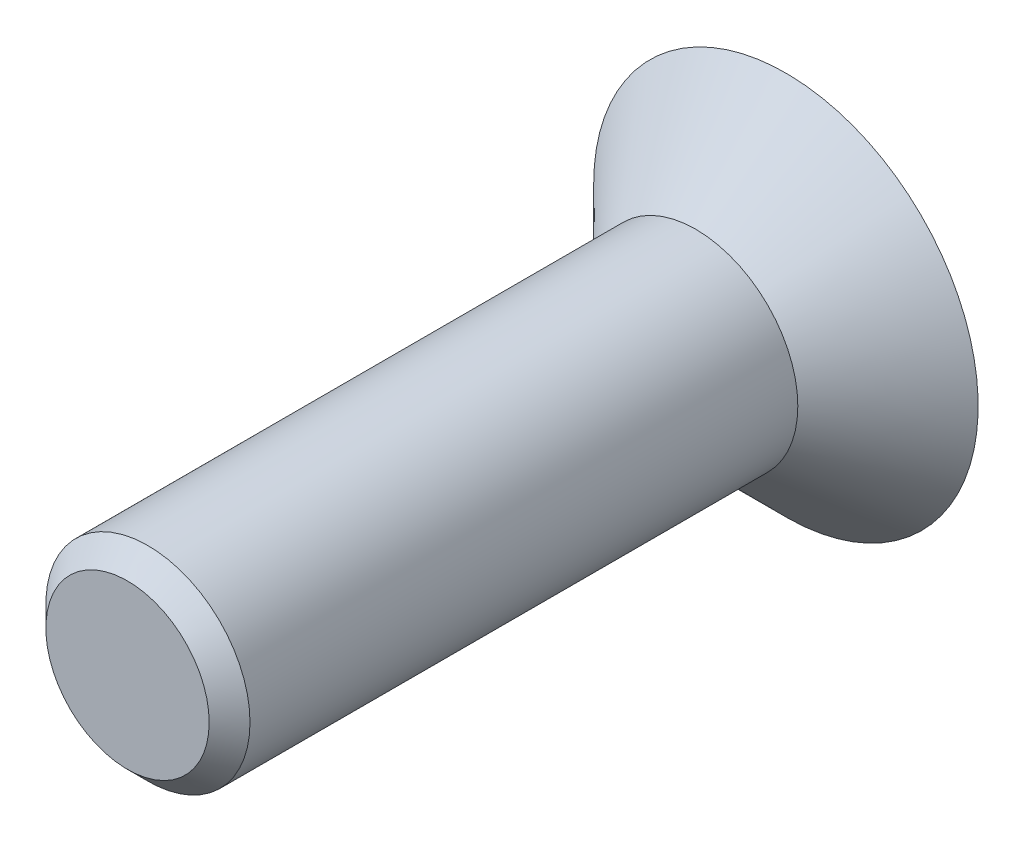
ISO-10303-21;
HEADER;
FILE_DESCRIPTION(('STEP AP214'),'2;1');
FILE_NAME('part.step','',(''),(''),'','','');
FILE_SCHEMA(('AUTOMOTIVE_DESIGN { 1 0 10303 214 1 1 1 1 }'));
ENDSEC;
DATA;
#1=APPLICATION_CONTEXT('core data for automotive mechanical design processes');
#2=APPLICATION_PROTOCOL_DEFINITION('international standard','automotive_design',2000,#1);
#3=PRODUCT_CONTEXT('',#1,'mechanical');
#4=PRODUCT('Part','Part','',(#3));
#5=PRODUCT_RELATED_PRODUCT_CATEGORY('part','',(#4));
#6=PRODUCT_DEFINITION_FORMATION('','',#4);
#7=PRODUCT_DEFINITION_CONTEXT('part definition',#1,'design');
#8=PRODUCT_DEFINITION('design','',#6,#7);
#9=PRODUCT_DEFINITION_SHAPE('','',#8);
#10=(LENGTH_UNIT() NAMED_UNIT(*) SI_UNIT(.MILLI.,.METRE.));
#11=(NAMED_UNIT(*) PLANE_ANGLE_UNIT() SI_UNIT($,.RADIAN.));
#12=(NAMED_UNIT(*) SI_UNIT($,.STERADIAN.) SOLID_ANGLE_UNIT());
#13=UNCERTAINTY_MEASURE_WITH_UNIT(LENGTH_MEASURE(1.E-05),#10,'distance_accuracy_value','');
#14=(GEOMETRIC_REPRESENTATION_CONTEXT(3) GLOBAL_UNCERTAINTY_ASSIGNED_CONTEXT((#13)) GLOBAL_UNIT_ASSIGNED_CONTEXT((#10,
#11,#12)) REPRESENTATION_CONTEXT('',''));
#15=CARTESIAN_POINT('',(0.,0.,0.));
#16=DIRECTION('',(0.,0.,1.));
#17=DIRECTION('',(1.,0.,0.));
#18=AXIS2_PLACEMENT_3D('',#15,#16,#17);
#19=CARTESIAN_POINT('',(0.,0.,-2.65));
#20=DIRECTION('',(0.,0.,1.));
#21=DIRECTION('',(1.,0.,0.));
#22=AXIS2_PLACEMENT_3D('',#19,#20,#21);
#23=PLANE('',#22);
#24=CARTESIAN_POINT('',(0.,0.,-2.65));
#25=DIRECTION('',(0.,0.,-1.));
#26=DIRECTION('',(-1.,0.,0.));
#27=AXIS2_PLACEMENT_3D('',#24,#25,#26);
#28=CIRCLE('',#27,5.65);
#29=CARTESIAN_POINT('',(-5.65,0.,-2.65));
#30=VERTEX_POINT('',#29);
#31=EDGE_CURVE('E86',#30,#30,#28,.T.);
#32=ORIENTED_EDGE('',*,*,#31,.T.);
#33=EDGE_LOOP('',(#32));
#34=FACE_BOUND('',#33,.T.);
#35=DIRECTION('',(-0.86602540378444,0.499999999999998,0.));
#36=VECTOR('',#35,1.);
#37=CARTESIAN_POINT('',(0.,2.30940107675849,-2.65000000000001));
#38=LINE('',#37,#36);
#39=CARTESIAN_POINT('',(2.00000000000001,1.15470053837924,-2.65));
#40=VERTEX_POINT('',#39);
#41=CARTESIAN_POINT('',(0.,2.30940107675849,-2.65000000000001));
#42=VERTEX_POINT('',#41);
#43=EDGE_CURVE('E43',#40,#42,#38,.T.);
#44=ORIENTED_EDGE('',*,*,#43,.T.);
#45=DIRECTION('',(-0.866025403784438,-0.500000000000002,0.));
#46=VECTOR('',#45,1.);
#47=CARTESIAN_POINT('',(-1.99999999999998,1.15470053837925,-2.65000000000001));
#48=LINE('',#47,#46);
#49=CARTESIAN_POINT('',(-1.99999999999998,1.15470053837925,-2.65000000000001));
#50=VERTEX_POINT('',#49);
#51=EDGE_CURVE('E143',#42,#50,#48,.T.);
#52=ORIENTED_EDGE('',*,*,#51,.T.);
#53=DIRECTION('',(0.,-1.,0.));
#54=VECTOR('',#53,1.);
#55=CARTESIAN_POINT('',(-1.99999999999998,-1.15470053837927,-2.65));
#56=LINE('',#55,#54);
#57=CARTESIAN_POINT('',(-1.99999999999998,-1.15470053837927,-2.65));
#58=VERTEX_POINT('',#57);
#59=EDGE_CURVE('E146',#50,#58,#56,.T.);
#60=ORIENTED_EDGE('',*,*,#59,.T.);
#61=DIRECTION('',(0.866025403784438,-0.500000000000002,0.));
#62=VECTOR('',#61,1.);
#63=CARTESIAN_POINT('',(-1.99999999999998,-1.15470053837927,-2.65));
#64=LINE('',#63,#62);
#65=CARTESIAN_POINT('',(0.,-2.30940107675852,-2.65));
#66=VERTEX_POINT('',#65);
#67=EDGE_CURVE('E152',#58,#66,#64,.T.);
#68=ORIENTED_EDGE('',*,*,#67,.T.);
#69=DIRECTION('',(0.86602540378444,0.499999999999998,0.));
#70=VECTOR('',#69,1.);
#71=CARTESIAN_POINT('',(0.,-2.30940107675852,-2.65));
#72=LINE('',#71,#70);
#73=CARTESIAN_POINT('',(2.00000000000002,-1.15470053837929,-2.65));
#74=VERTEX_POINT('',#73);
#75=EDGE_CURVE('E155',#66,#74,#72,.T.);
#76=ORIENTED_EDGE('',*,*,#75,.T.);
#77=DIRECTION('',(0.,1.,0.));
#78=VECTOR('',#77,1.);
#79=CARTESIAN_POINT('',(2.00000000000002,-1.15470053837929,-2.65));
#80=LINE('',#79,#78);
#81=EDGE_CURVE('E92',#74,#40,#80,.T.);
#82=ORIENTED_EDGE('',*,*,#81,.T.);
#83=EDGE_LOOP('',(#44,#52,#60,#68,#76,#82));
#84=FACE_BOUND('',#83,.T.);
#85=ADVANCED_FACE('F29',(#34,#84),#23,.F.);
#86=CARTESIAN_POINT('',(0.,0.,0.));
#87=DIRECTION('',(0.,0.,-1.));
#88=DIRECTION('',(-1.,0.,0.));
#89=AXIS2_PLACEMENT_3D('',#86,#87,#88);
#90=CONICAL_SURFACE('',#89,3.,0.78539816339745);
#91=ORIENTED_EDGE('',*,*,#31,.F.);
#92=EDGE_LOOP('',(#91));
#93=FACE_BOUND('',#92,.T.);
#94=CARTESIAN_POINT('',(0.,0.,0.));
#95=DIRECTION('',(0.,0.,1.));
#96=DIRECTION('',(1.,0.,0.));
#97=AXIS2_PLACEMENT_3D('',#94,#95,#96);
#98=CIRCLE('',#97,3.);
#99=CARTESIAN_POINT('',(3.,0.,0.));
#100=VERTEX_POINT('',#99);
#101=EDGE_CURVE('E144',#100,#100,#98,.T.);
#102=ORIENTED_EDGE('',*,*,#101,.F.);
#103=EDGE_LOOP('',(#102));
#104=FACE_BOUND('',#103,.T.);
#105=ADVANCED_FACE('F130',(#93,#104),#90,.T.);
#106=CARTESIAN_POINT('',(0.,2.30940107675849,0.150000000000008));
#107=DIRECTION('',(-0.499999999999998,-0.86602540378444,0.));
#108=DIRECTION('',(0.86602540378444,-0.499999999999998,0.));
#109=AXIS2_PLACEMENT_3D('',#106,#107,#108);
#110=PLANE('',#109);
#111=DIRECTION('',(-0.86602540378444,0.499999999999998,0.));
#112=VECTOR('',#111,1.);
#113=CARTESIAN_POINT('',(1.00000000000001,1.73205080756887,0.));
#114=LINE('',#113,#112);
#115=CARTESIAN_POINT('',(2.00000000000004,1.15470053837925,0.));
#116=VERTEX_POINT('',#115);
#117=CARTESIAN_POINT('',(0.,2.30940107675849,0.));
#118=VERTEX_POINT('',#117);
#119=EDGE_CURVE('E51',#116,#118,#114,.T.);
#120=ORIENTED_EDGE('',*,*,#119,.T.);
#121=DIRECTION('',(0.,0.,-1.));
#122=VECTOR('',#121,1.);
#123=CARTESIAN_POINT('',(0.,2.30940107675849,0.150000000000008));
#124=LINE('',#123,#122);
#125=EDGE_CURVE('E164',#118,#42,#124,.T.);
#126=ORIENTED_EDGE('',*,*,#125,.T.);
#127=ORIENTED_EDGE('',*,*,#43,.F.);
#128=DIRECTION('',(0.,0.,-1.));
#129=VECTOR('',#128,1.);
#130=CARTESIAN_POINT('',(2.00000000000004,1.15470053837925,0.149999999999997));
#131=LINE('',#130,#129);
#132=EDGE_CURVE('E97',#116,#40,#131,.T.);
#133=ORIENTED_EDGE('',*,*,#132,.F.);
#134=EDGE_LOOP('',(#120,#126,#127,#133));
#135=FACE_BOUND('',#134,.T.);
#136=ADVANCED_FACE('F135',(#135),#110,.T.);
#137=CARTESIAN_POINT('',(-2.,1.15470053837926,0.150000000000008));
#138=DIRECTION('',(0.500000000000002,-0.866025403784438,0.));
#139=DIRECTION('',(0.866025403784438,0.500000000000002,0.));
#140=AXIS2_PLACEMENT_3D('',#137,#138,#139);
#141=PLANE('',#140);
#142=DIRECTION('',(-0.866025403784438,-0.500000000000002,0.));
#143=VECTOR('',#142,1.);
#144=CARTESIAN_POINT('',(-0.99999999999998,1.73205080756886,0.));
#145=LINE('',#144,#143);
#146=CARTESIAN_POINT('',(-1.99999999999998,1.15470053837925,0.));
#147=VERTEX_POINT('',#146);
#148=EDGE_CURVE('E109',#118,#147,#145,.T.);
#149=ORIENTED_EDGE('',*,*,#148,.T.);
#150=DIRECTION('',(0.,0.,-1.));
#151=VECTOR('',#150,1.);
#152=CARTESIAN_POINT('',(-2.,1.15470053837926,0.150000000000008));
#153=LINE('',#152,#151);
#154=EDGE_CURVE('E162',#147,#50,#153,.T.);
#155=ORIENTED_EDGE('',*,*,#154,.T.);
#156=ORIENTED_EDGE('',*,*,#51,.F.);
#157=ORIENTED_EDGE('',*,*,#125,.F.);
#158=EDGE_LOOP('',(#149,#155,#156,#157));
#159=FACE_BOUND('',#158,.T.);
#160=ADVANCED_FACE('F167',(#159),#141,.T.);
#161=CARTESIAN_POINT('',(-1.99999999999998,-1.15470053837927,0.150000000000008));
#162=DIRECTION('',(1.,0.,0.));
#163=DIRECTION('',(0.,0.,-1.));
#164=AXIS2_PLACEMENT_3D('',#161,#162,#163);
#165=PLANE('',#164);
#166=DIRECTION('',(0.,-1.,0.));
#167=VECTOR('',#166,1.);
#168=CARTESIAN_POINT('',(-1.99999999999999,0.,0.));
#169=LINE('',#168,#167);
#170=CARTESIAN_POINT('',(-1.99999999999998,-1.15470053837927,0.));
#171=VERTEX_POINT('',#170);
#172=EDGE_CURVE('E103',#147,#171,#169,.T.);
#173=ORIENTED_EDGE('',*,*,#172,.T.);
#174=DIRECTION('',(0.,0.,-1.));
#175=VECTOR('',#174,1.);
#176=CARTESIAN_POINT('',(-1.99999999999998,-1.15470053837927,0.150000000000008));
#177=LINE('',#176,#175);
#178=EDGE_CURVE('E160',#171,#58,#177,.T.);
#179=ORIENTED_EDGE('',*,*,#178,.T.);
#180=ORIENTED_EDGE('',*,*,#59,.F.);
#181=ORIENTED_EDGE('',*,*,#154,.F.);
#182=EDGE_LOOP('',(#173,#179,#180,#181));
#183=FACE_BOUND('',#182,.T.);
#184=ADVANCED_FACE('F171',(#183),#165,.T.);
#185=CARTESIAN_POINT('',(-1.99999999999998,-1.15470053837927,0.150000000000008));
#186=DIRECTION('',(0.500000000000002,0.866025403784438,0.));
#187=DIRECTION('',(-0.866025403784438,0.500000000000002,0.));
#188=AXIS2_PLACEMENT_3D('',#185,#186,#187);
#189=PLANE('',#188);
#190=DIRECTION('',(0.866025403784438,-0.500000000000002,0.));
#191=VECTOR('',#190,1.);
#192=CARTESIAN_POINT('',(-1.,-1.73205080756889,0.));
#193=LINE('',#192,#191);
#194=CARTESIAN_POINT('',(0.,-2.30940107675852,0.));
#195=VERTEX_POINT('',#194);
#196=EDGE_CURVE('E101',#171,#195,#193,.T.);
#197=ORIENTED_EDGE('',*,*,#196,.T.);
#198=DIRECTION('',(0.,0.,-1.));
#199=VECTOR('',#198,1.);
#200=CARTESIAN_POINT('',(0.,-2.30940107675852,0.150000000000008));
#201=LINE('',#200,#199);
#202=EDGE_CURVE('E96',#195,#66,#201,.T.);
#203=ORIENTED_EDGE('',*,*,#202,.T.);
#204=ORIENTED_EDGE('',*,*,#67,.F.);
#205=ORIENTED_EDGE('',*,*,#178,.F.);
#206=EDGE_LOOP('',(#197,#203,#204,#205));
#207=FACE_BOUND('',#206,.T.);
#208=ADVANCED_FACE('F175',(#207),#189,.T.);
#209=CARTESIAN_POINT('',(0.,-2.30940107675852,0.150000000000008));
#210=DIRECTION('',(-0.499999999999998,0.86602540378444,0.));
#211=DIRECTION('',(-0.86602540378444,-0.499999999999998,0.));
#212=AXIS2_PLACEMENT_3D('',#209,#210,#211);
#213=PLANE('',#212);
#214=DIRECTION('',(0.86602540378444,0.499999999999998,0.));
#215=VECTOR('',#214,1.);
#216=CARTESIAN_POINT('',(0.999999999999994,-1.7320508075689,0.));
#217=LINE('',#216,#215);
#218=CARTESIAN_POINT('',(2.00000000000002,-1.15470053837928,0.));
#219=VERTEX_POINT('',#218);
#220=EDGE_CURVE('E83',#195,#219,#217,.T.);
#221=ORIENTED_EDGE('',*,*,#220,.T.);
#222=DIRECTION('',(0.,0.,-1.));
#223=VECTOR('',#222,1.);
#224=CARTESIAN_POINT('',(2.00000000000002,-1.15470053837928,0.149999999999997));
#225=LINE('',#224,#223);
#226=EDGE_CURVE('E89',#219,#74,#225,.T.);
#227=ORIENTED_EDGE('',*,*,#226,.T.);
#228=ORIENTED_EDGE('',*,*,#75,.F.);
#229=ORIENTED_EDGE('',*,*,#202,.F.);
#230=EDGE_LOOP('',(#221,#227,#228,#229));
#231=FACE_BOUND('',#230,.T.);
#232=ADVANCED_FACE('F100',(#231),#213,.T.);
#233=CARTESIAN_POINT('',(2.00000000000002,-1.15470053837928,0.149999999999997));
#234=DIRECTION('',(-1.,0.,0.));
#235=DIRECTION('',(0.,0.,1.));
#236=AXIS2_PLACEMENT_3D('',#233,#234,#235);
#237=PLANE('',#236);
#238=DIRECTION('',(0.,1.,0.));
#239=VECTOR('',#238,1.);
#240=CARTESIAN_POINT('',(2.00000000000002,0.,0.));
#241=LINE('',#240,#239);
#242=EDGE_CURVE('E79',#219,#116,#241,.T.);
#243=ORIENTED_EDGE('',*,*,#242,.T.);
#244=ORIENTED_EDGE('',*,*,#132,.T.);
#245=ORIENTED_EDGE('',*,*,#81,.F.);
#246=ORIENTED_EDGE('',*,*,#226,.F.);
#247=EDGE_LOOP('',(#243,#244,#245,#246));
#248=FACE_BOUND('',#247,.T.);
#249=ADVANCED_FACE('F90',(#248),#237,.T.);
#250=CARTESIAN_POINT('',(0.,0.,0.));
#251=DIRECTION('',(0.,0.,-1.));
#252=DIRECTION('',(-1.,0.,0.));
#253=AXIS2_PLACEMENT_3D('',#250,#251,#252);
#254=PLANE('',#253);
#255=ORIENTED_EDGE('',*,*,#148,.F.);
#256=ORIENTED_EDGE('',*,*,#119,.F.);
#257=ORIENTED_EDGE('',*,*,#242,.F.);
#258=ORIENTED_EDGE('',*,*,#220,.F.);
#259=ORIENTED_EDGE('',*,*,#196,.F.);
#260=ORIENTED_EDGE('',*,*,#172,.F.);
#261=EDGE_LOOP('',(#255,#256,#257,#258,#259,#260));
#262=FACE_BOUND('',#261,.T.);
#263=ADVANCED_FACE('F81',(#262),#254,.T.);
#264=CARTESIAN_POINT('',(0.,0.,16.7));
#265=DIRECTION('',(0.,0.,1.));
#266=DIRECTION('',(1.,0.,0.));
#267=AXIS2_PLACEMENT_3D('',#264,#265,#266);
#268=PLANE('',#267);
#269=CARTESIAN_POINT('',(0.,0.,16.7));
#270=DIRECTION('',(0.,0.,1.));
#271=DIRECTION('',(1.,0.,0.));
#272=AXIS2_PLACEMENT_3D('',#269,#270,#271);
#273=CIRCLE('',#272,2.39999999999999);
#274=CARTESIAN_POINT('',(2.40000000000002,0.,16.7));
#275=VERTEX_POINT('',#274);
#276=EDGE_CURVE('E36',#275,#275,#273,.T.);
#277=ORIENTED_EDGE('',*,*,#276,.T.);
#278=EDGE_LOOP('',(#277));
#279=FACE_BOUND('',#278,.T.);
#280=ADVANCED_FACE('F115',(#279),#268,.T.);
#281=CARTESIAN_POINT('',(0.,0.,0.));
#282=DIRECTION('',(0.,0.,1.));
#283=DIRECTION('',(1.,0.,0.));
#284=AXIS2_PLACEMENT_3D('',#281,#282,#283);
#285=CYLINDRICAL_SURFACE('',#284,3.);
#286=CARTESIAN_POINT('',(0.,0.,16.1));
#287=DIRECTION('',(0.,0.,1.));
#288=DIRECTION('',(1.,0.,0.));
#289=AXIS2_PLACEMENT_3D('',#286,#287,#288);
#290=CIRCLE('',#289,3.);
#291=CARTESIAN_POINT('',(3.00000000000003,0.,16.1));
#292=VERTEX_POINT('',#291);
#293=EDGE_CURVE('E11',#292,#292,#290,.F.);
#294=ORIENTED_EDGE('',*,*,#293,.T.);
#295=EDGE_LOOP('',(#294));
#296=FACE_BOUND('',#295,.T.);
#297=ORIENTED_EDGE('',*,*,#101,.T.);
#298=EDGE_LOOP('',(#297));
#299=FACE_BOUND('',#298,.T.);
#300=ADVANCED_FACE('F119',(#296,#299),#285,.T.);
#301=CARTESIAN_POINT('',(0.,0.,16.7));
#302=DIRECTION('',(0.,0.,-1.));
#303=DIRECTION('',(-1.,0.,0.));
#304=AXIS2_PLACEMENT_3D('',#301,#302,#303);
#305=CONICAL_SURFACE('',#304,2.39999999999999,0.785398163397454);
#306=ORIENTED_EDGE('',*,*,#293,.F.);
#307=EDGE_LOOP('',(#306));
#308=FACE_BOUND('',#307,.T.);
#309=ORIENTED_EDGE('',*,*,#276,.F.);
#310=EDGE_LOOP('',(#309));
#311=FACE_BOUND('',#310,.T.);
#312=ADVANCED_FACE('F117',(#308,#311),#305,.T.);
#313=CLOSED_SHELL('',(#85,#105,#136,#160,#184,#208,#232,#249,#263,#280,#300,#312));
#314=MANIFOLD_SOLID_BREP('B2',#313);
#315=ADVANCED_BREP_SHAPE_REPRESENTATION('',(#18,#314),#14);
#316=SHAPE_DEFINITION_REPRESENTATION(#9,#315);
ENDSEC;
END-ISO-10303-21;
